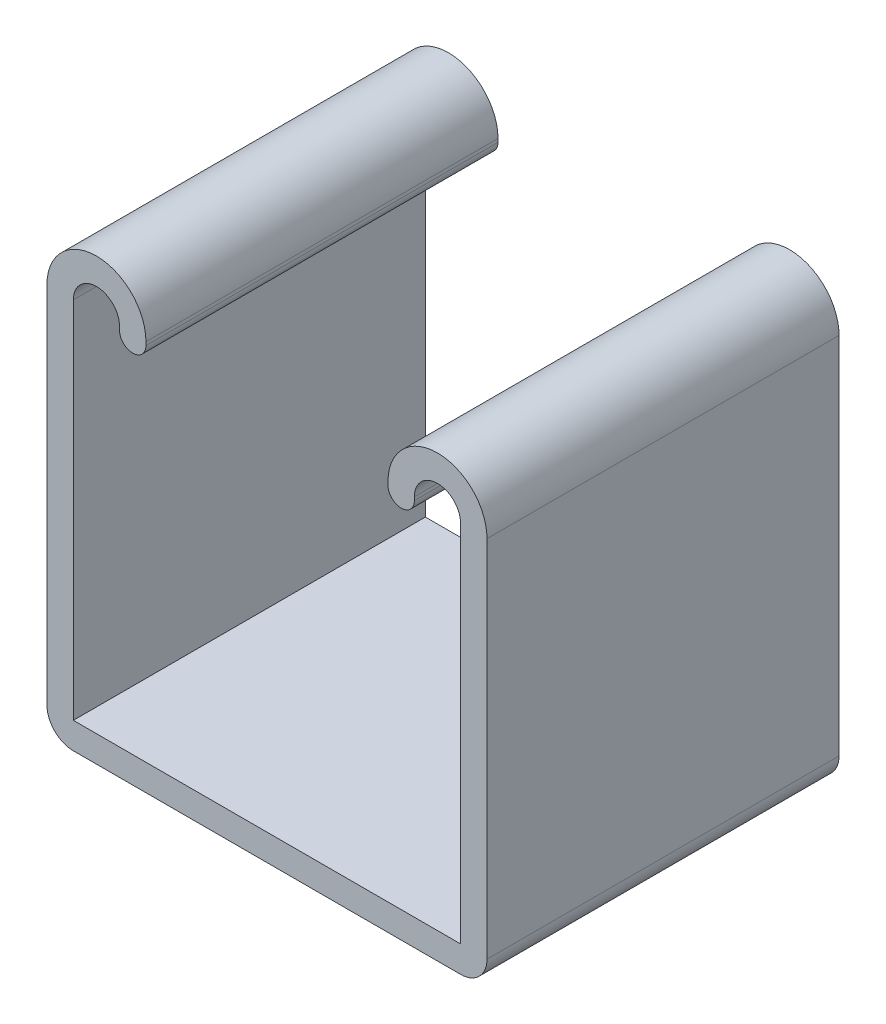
ISO-10303-21;
HEADER;
FILE_DESCRIPTION(('STEP AP214'),'2;1');
FILE_NAME('part.step','',(''),(''),'','','');
FILE_SCHEMA(('AUTOMOTIVE_DESIGN { 1 0 10303 214 1 1 1 1 }'));
ENDSEC;
DATA;
#1=APPLICATION_CONTEXT('core data for automotive mechanical design processes');
#2=APPLICATION_PROTOCOL_DEFINITION('international standard','automotive_design',2000,#1);
#3=PRODUCT_CONTEXT('',#1,'mechanical');
#4=PRODUCT('Part','Part','',(#3));
#5=PRODUCT_RELATED_PRODUCT_CATEGORY('part','',(#4));
#6=PRODUCT_DEFINITION_FORMATION('','',#4);
#7=PRODUCT_DEFINITION_CONTEXT('part definition',#1,'design');
#8=PRODUCT_DEFINITION('design','',#6,#7);
#9=PRODUCT_DEFINITION_SHAPE('','',#8);
#10=(LENGTH_UNIT() NAMED_UNIT(*) SI_UNIT(.MILLI.,.METRE.));
#11=(NAMED_UNIT(*) PLANE_ANGLE_UNIT() SI_UNIT($,.RADIAN.));
#12=(NAMED_UNIT(*) SI_UNIT($,.STERADIAN.) SOLID_ANGLE_UNIT());
#13=UNCERTAINTY_MEASURE_WITH_UNIT(LENGTH_MEASURE(1.E-05),#10,'distance_accuracy_value','');
#14=(GEOMETRIC_REPRESENTATION_CONTEXT(3) GLOBAL_UNCERTAINTY_ASSIGNED_CONTEXT((#13)) GLOBAL_UNIT_ASSIGNED_CONTEXT((#10,
#11,#12)) REPRESENTATION_CONTEXT('',''));
#15=CARTESIAN_POINT('',(0.,0.,0.));
#16=DIRECTION('',(0.,0.,1.));
#17=DIRECTION('',(1.,0.,0.));
#18=AXIS2_PLACEMENT_3D('',#15,#16,#17);
#19=CARTESIAN_POINT('',(-12.303125,14.360525,12.7));
#20=DIRECTION('',(0.,0.,-1.));
#21=DIRECTION('',(-1.,0.,0.));
#22=AXIS2_PLACEMENT_3D('',#19,#20,#21);
#23=CYLINDRICAL_SURFACE('',#22,3.571875);
#24=CARTESIAN_POINT('',(-12.303125,14.360525,-12.7));
#25=DIRECTION('',(0.,0.,1.));
#26=DIRECTION('',(-1.,0.,0.));
#27=AXIS2_PLACEMENT_3D('',#24,#25,#26);
#28=CIRCLE('',#27,3.571875);
#29=CARTESIAN_POINT('',(-8.73125,14.360525,-12.7));
#30=VERTEX_POINT('',#29);
#31=CARTESIAN_POINT('',(-15.875,14.360525,-12.7));
#32=VERTEX_POINT('',#31);
#33=EDGE_CURVE('E189',#30,#32,#28,.T.);
#34=ORIENTED_EDGE('',*,*,#33,.T.);
#35=DIRECTION('',(0.,0.,-1.));
#36=VECTOR('',#35,1.);
#37=CARTESIAN_POINT('',(-15.875,14.360525,12.7));
#38=LINE('',#37,#36);
#39=CARTESIAN_POINT('',(-15.875,14.360525,12.7));
#40=VERTEX_POINT('',#39);
#41=EDGE_CURVE('E11',#40,#32,#38,.T.);
#42=ORIENTED_EDGE('',*,*,#41,.F.);
#43=CARTESIAN_POINT('',(-12.303125,14.360525,12.7));
#44=DIRECTION('',(0.,0.,1.));
#45=DIRECTION('',(-1.,0.,0.));
#46=AXIS2_PLACEMENT_3D('',#43,#44,#45);
#47=CIRCLE('',#46,3.571875);
#48=CARTESIAN_POINT('',(-8.73125,14.360525,12.7));
#49=VERTEX_POINT('',#48);
#50=EDGE_CURVE('E223',#49,#40,#47,.T.);
#51=ORIENTED_EDGE('',*,*,#50,.F.);
#52=DIRECTION('',(0.,0.,-1.));
#53=VECTOR('',#52,1.);
#54=CARTESIAN_POINT('',(-8.73125,14.360525,12.7));
#55=LINE('',#54,#53);
#56=EDGE_CURVE('E185',#49,#30,#55,.T.);
#57=ORIENTED_EDGE('',*,*,#56,.T.);
#58=EDGE_LOOP('',(#34,#42,#51,#57));
#59=FACE_BOUND('',#58,.T.);
#60=ADVANCED_FACE('F33',(#59),#23,.T.);
#61=CARTESIAN_POINT('',(-15.875,14.360525,12.7));
#62=DIRECTION('',(1.,0.,0.));
#63=DIRECTION('',(0.,1.,0.));
#64=AXIS2_PLACEMENT_3D('',#61,#62,#63);
#65=PLANE('',#64);
#66=DIRECTION('',(0.,-1.,0.));
#67=VECTOR('',#66,1.);
#68=CARTESIAN_POINT('',(-15.875,14.360525,-12.7));
#69=LINE('',#68,#67);
#70=CARTESIAN_POINT('',(-15.875,-11.9126,-12.7));
#71=VERTEX_POINT('',#70);
#72=EDGE_CURVE('E192',#32,#71,#69,.T.);
#73=ORIENTED_EDGE('',*,*,#72,.T.);
#74=DIRECTION('',(0.,0.,-1.));
#75=VECTOR('',#74,1.);
#76=CARTESIAN_POINT('',(-15.875,-11.9126,12.7));
#77=LINE('',#76,#75);
#78=CARTESIAN_POINT('',(-15.875,-11.9126,12.7));
#79=VERTEX_POINT('',#78);
#80=EDGE_CURVE('E41',#79,#71,#77,.T.);
#81=ORIENTED_EDGE('',*,*,#80,.F.);
#82=DIRECTION('',(0.,-1.,0.));
#83=VECTOR('',#82,1.);
#84=CARTESIAN_POINT('',(-15.875,14.360525,12.7));
#85=LINE('',#84,#83);
#86=EDGE_CURVE('E122',#40,#79,#85,.T.);
#87=ORIENTED_EDGE('',*,*,#86,.F.);
#88=ORIENTED_EDGE('',*,*,#41,.T.);
#89=EDGE_LOOP('',(#73,#81,#87,#88));
#90=FACE_BOUND('',#89,.T.);
#91=ADVANCED_FACE('F331',(#90),#65,.F.);
#92=CARTESIAN_POINT('',(-13.97,-11.9126,12.7));
#93=DIRECTION('',(0.,0.,-1.));
#94=DIRECTION('',(-1.,0.,0.));
#95=AXIS2_PLACEMENT_3D('',#92,#93,#94);
#96=CYLINDRICAL_SURFACE('',#95,1.905);
#97=CARTESIAN_POINT('',(-13.97,-11.9126,-12.7));
#98=DIRECTION('',(0.,0.,1.));
#99=DIRECTION('',(-1.,0.,0.));
#100=AXIS2_PLACEMENT_3D('',#97,#98,#99);
#101=CIRCLE('',#100,1.905);
#102=CARTESIAN_POINT('',(-13.97,-13.8176,-12.7));
#103=VERTEX_POINT('',#102);
#104=EDGE_CURVE('E194',#71,#103,#101,.T.);
#105=ORIENTED_EDGE('',*,*,#104,.T.);
#106=DIRECTION('',(0.,0.,-1.));
#107=VECTOR('',#106,1.);
#108=CARTESIAN_POINT('',(-13.97,-13.8176,12.7));
#109=LINE('',#108,#107);
#110=CARTESIAN_POINT('',(-13.97,-13.8176,12.7));
#111=VERTEX_POINT('',#110);
#112=EDGE_CURVE('E260',#111,#103,#109,.T.);
#113=ORIENTED_EDGE('',*,*,#112,.F.);
#114=CARTESIAN_POINT('',(-13.97,-11.9126,12.7));
#115=DIRECTION('',(0.,0.,1.));
#116=DIRECTION('',(-1.,0.,0.));
#117=AXIS2_PLACEMENT_3D('',#114,#115,#116);
#118=CIRCLE('',#117,1.905);
#119=EDGE_CURVE('E268',#79,#111,#118,.T.);
#120=ORIENTED_EDGE('',*,*,#119,.F.);
#121=ORIENTED_EDGE('',*,*,#80,.T.);
#122=EDGE_LOOP('',(#105,#113,#120,#121));
#123=FACE_BOUND('',#122,.T.);
#124=ADVANCED_FACE('F266',(#123),#96,.T.);
#125=CARTESIAN_POINT('',(-13.97,-13.8176,12.7));
#126=DIRECTION('',(0.,1.,0.));
#127=DIRECTION('',(-1.,0.,0.));
#128=AXIS2_PLACEMENT_3D('',#125,#126,#127);
#129=PLANE('',#128);
#130=DIRECTION('',(1.,0.,0.));
#131=VECTOR('',#130,1.);
#132=CARTESIAN_POINT('',(-13.97,-13.8176,-12.7));
#133=LINE('',#132,#131);
#134=CARTESIAN_POINT('',(13.97,-13.8176,-12.7));
#135=VERTEX_POINT('',#134);
#136=EDGE_CURVE('E196',#103,#135,#133,.T.);
#137=ORIENTED_EDGE('',*,*,#136,.T.);
#138=DIRECTION('',(0.,0.,-1.));
#139=VECTOR('',#138,1.);
#140=CARTESIAN_POINT('',(13.97,-13.8176,12.7));
#141=LINE('',#140,#139);
#142=CARTESIAN_POINT('',(13.97,-13.8176,12.7));
#143=VERTEX_POINT('',#142);
#144=EDGE_CURVE('E257',#143,#135,#141,.T.);
#145=ORIENTED_EDGE('',*,*,#144,.F.);
#146=DIRECTION('',(1.,0.,0.));
#147=VECTOR('',#146,1.);
#148=CARTESIAN_POINT('',(-13.97,-13.8176,12.7));
#149=LINE('',#148,#147);
#150=EDGE_CURVE('E286',#111,#143,#149,.T.);
#151=ORIENTED_EDGE('',*,*,#150,.F.);
#152=ORIENTED_EDGE('',*,*,#112,.T.);
#153=EDGE_LOOP('',(#137,#145,#151,#152));
#154=FACE_BOUND('',#153,.T.);
#155=ADVANCED_FACE('F277',(#154),#129,.F.);
#156=CARTESIAN_POINT('',(13.97,-11.9126,12.7));
#157=DIRECTION('',(0.,0.,-1.));
#158=DIRECTION('',(-1.,0.,0.));
#159=AXIS2_PLACEMENT_3D('',#156,#157,#158);
#160=CYLINDRICAL_SURFACE('',#159,1.905);
#161=CARTESIAN_POINT('',(13.97,-11.9126,-12.7));
#162=DIRECTION('',(0.,0.,1.));
#163=DIRECTION('',(1.,0.,0.));
#164=AXIS2_PLACEMENT_3D('',#161,#162,#163);
#165=CIRCLE('',#164,1.905);
#166=CARTESIAN_POINT('',(15.875,-11.9126,-12.7));
#167=VERTEX_POINT('',#166);
#168=EDGE_CURVE('E198',#135,#167,#165,.T.);
#169=ORIENTED_EDGE('',*,*,#168,.T.);
#170=DIRECTION('',(0.,0.,-1.));
#171=VECTOR('',#170,1.);
#172=CARTESIAN_POINT('',(15.875,-11.9126,12.7));
#173=LINE('',#172,#171);
#174=CARTESIAN_POINT('',(15.875,-11.9126,12.7));
#175=VERTEX_POINT('',#174);
#176=EDGE_CURVE('E254',#175,#167,#173,.T.);
#177=ORIENTED_EDGE('',*,*,#176,.F.);
#178=CARTESIAN_POINT('',(13.97,-11.9126,12.7));
#179=DIRECTION('',(0.,0.,1.));
#180=DIRECTION('',(1.,0.,0.));
#181=AXIS2_PLACEMENT_3D('',#178,#179,#180);
#182=CIRCLE('',#181,1.905);
#183=EDGE_CURVE('E283',#143,#175,#182,.T.);
#184=ORIENTED_EDGE('',*,*,#183,.F.);
#185=ORIENTED_EDGE('',*,*,#144,.T.);
#186=EDGE_LOOP('',(#169,#177,#184,#185));
#187=FACE_BOUND('',#186,.T.);
#188=ADVANCED_FACE('F281',(#187),#160,.T.);
#189=CARTESIAN_POINT('',(15.875,-11.9126,12.7));
#190=DIRECTION('',(-1.,0.,0.));
#191=DIRECTION('',(0.,0.,1.));
#192=AXIS2_PLACEMENT_3D('',#189,#190,#191);
#193=PLANE('',#192);
#194=DIRECTION('',(0.,1.,0.));
#195=VECTOR('',#194,1.);
#196=CARTESIAN_POINT('',(15.875,-11.9126,-12.7));
#197=LINE('',#196,#195);
#198=CARTESIAN_POINT('',(15.875,14.360525,-12.7));
#199=VERTEX_POINT('',#198);
#200=EDGE_CURVE('E200',#167,#199,#197,.T.);
#201=ORIENTED_EDGE('',*,*,#200,.T.);
#202=DIRECTION('',(0.,0.,-1.));
#203=VECTOR('',#202,1.);
#204=CARTESIAN_POINT('',(15.875,14.360525,12.7));
#205=LINE('',#204,#203);
#206=CARTESIAN_POINT('',(15.875,14.360525,12.7));
#207=VERTEX_POINT('',#206);
#208=EDGE_CURVE('E251',#207,#199,#205,.T.);
#209=ORIENTED_EDGE('',*,*,#208,.F.);
#210=DIRECTION('',(0.,1.,0.));
#211=VECTOR('',#210,1.);
#212=CARTESIAN_POINT('',(15.875,-11.9126,12.7));
#213=LINE('',#212,#211);
#214=EDGE_CURVE('E285',#175,#207,#213,.T.);
#215=ORIENTED_EDGE('',*,*,#214,.F.);
#216=ORIENTED_EDGE('',*,*,#176,.T.);
#217=EDGE_LOOP('',(#201,#209,#215,#216));
#218=FACE_BOUND('',#217,.T.);
#219=ADVANCED_FACE('F344',(#218),#193,.F.);
#220=CARTESIAN_POINT('',(12.303125,14.360525,12.7));
#221=DIRECTION('',(0.,0.,-1.));
#222=DIRECTION('',(-1.,0.,0.));
#223=AXIS2_PLACEMENT_3D('',#220,#221,#222);
#224=CYLINDRICAL_SURFACE('',#223,3.571875);
#225=CARTESIAN_POINT('',(12.303125,14.360525,-12.7));
#226=DIRECTION('',(0.,0.,1.));
#227=DIRECTION('',(1.,0.,0.));
#228=AXIS2_PLACEMENT_3D('',#225,#226,#227);
#229=CIRCLE('',#228,3.571875);
#230=CARTESIAN_POINT('',(8.73125,14.360525,-12.7));
#231=VERTEX_POINT('',#230);
#232=EDGE_CURVE('E202',#199,#231,#229,.T.);
#233=ORIENTED_EDGE('',*,*,#232,.T.);
#234=DIRECTION('',(0.,0.,-1.));
#235=VECTOR('',#234,1.);
#236=CARTESIAN_POINT('',(8.73125,14.360525,12.7));
#237=LINE('',#236,#235);
#238=CARTESIAN_POINT('',(8.73125,14.360525,12.7));
#239=VERTEX_POINT('',#238);
#240=EDGE_CURVE('E248',#239,#231,#237,.T.);
#241=ORIENTED_EDGE('',*,*,#240,.F.);
#242=CARTESIAN_POINT('',(12.303125,14.360525,12.7));
#243=DIRECTION('',(0.,0.,1.));
#244=DIRECTION('',(1.,0.,0.));
#245=AXIS2_PLACEMENT_3D('',#242,#243,#244);
#246=CIRCLE('',#245,3.571875);
#247=EDGE_CURVE('E288',#207,#239,#246,.T.);
#248=ORIENTED_EDGE('',*,*,#247,.F.);
#249=ORIENTED_EDGE('',*,*,#208,.T.);
#250=EDGE_LOOP('',(#233,#241,#248,#249));
#251=FACE_BOUND('',#250,.T.);
#252=ADVANCED_FACE('F347',(#251),#224,.T.);
#253=CARTESIAN_POINT('',(8.73125,14.360525,12.7));
#254=DIRECTION('',(1.,0.,0.));
#255=DIRECTION('',(0.,0.,-1.));
#256=AXIS2_PLACEMENT_3D('',#253,#254,#255);
#257=PLANE('',#256);
#258=DIRECTION('',(0.,-1.,0.));
#259=VECTOR('',#258,1.);
#260=CARTESIAN_POINT('',(8.73125,14.360525,-12.7));
#261=LINE('',#260,#259);
#262=CARTESIAN_POINT('',(8.73125,14.1224,-12.7));
#263=VERTEX_POINT('',#262);
#264=EDGE_CURVE('E204',#231,#263,#261,.T.);
#265=ORIENTED_EDGE('',*,*,#264,.T.);
#266=DIRECTION('',(0.,0.,-1.));
#267=VECTOR('',#266,1.);
#268=CARTESIAN_POINT('',(8.73125,14.1224,12.7));
#269=LINE('',#268,#267);
#270=CARTESIAN_POINT('',(8.73125,14.1224,12.7));
#271=VERTEX_POINT('',#270);
#272=EDGE_CURVE('E245',#271,#263,#269,.T.);
#273=ORIENTED_EDGE('',*,*,#272,.F.);
#274=DIRECTION('',(0.,-1.,0.));
#275=VECTOR('',#274,1.);
#276=CARTESIAN_POINT('',(8.73125,14.360525,12.7));
#277=LINE('',#276,#275);
#278=EDGE_CURVE('E294',#239,#271,#277,.T.);
#279=ORIENTED_EDGE('',*,*,#278,.F.);
#280=ORIENTED_EDGE('',*,*,#240,.T.);
#281=EDGE_LOOP('',(#265,#273,#279,#280));
#282=FACE_BOUND('',#281,.T.);
#283=ADVANCED_FACE('F351',(#282),#257,.F.);
#284=CARTESIAN_POINT('',(9.68375,14.1224,12.7));
#285=DIRECTION('',(0.,0.,-1.));
#286=DIRECTION('',(-1.,0.,0.));
#287=AXIS2_PLACEMENT_3D('',#284,#285,#286);
#288=CYLINDRICAL_SURFACE('',#287,0.9525);
#289=CARTESIAN_POINT('',(9.68375,14.1224,-12.7));
#290=DIRECTION('',(0.,0.,1.));
#291=DIRECTION('',(1.,0.,0.));
#292=AXIS2_PLACEMENT_3D('',#289,#290,#291);
#293=CIRCLE('',#292,0.9525);
#294=CARTESIAN_POINT('',(10.63625,14.1224,-12.7));
#295=VERTEX_POINT('',#294);
#296=EDGE_CURVE('E206',#263,#295,#293,.T.);
#297=ORIENTED_EDGE('',*,*,#296,.T.);
#298=DIRECTION('',(0.,0.,-1.));
#299=VECTOR('',#298,1.);
#300=CARTESIAN_POINT('',(10.63625,14.1224,12.7));
#301=LINE('',#300,#299);
#302=CARTESIAN_POINT('',(10.63625,14.1224,12.7));
#303=VERTEX_POINT('',#302);
#304=EDGE_CURVE('E242',#303,#295,#301,.T.);
#305=ORIENTED_EDGE('',*,*,#304,.F.);
#306=CARTESIAN_POINT('',(9.68375,14.1224,12.7));
#307=DIRECTION('',(0.,0.,1.));
#308=DIRECTION('',(1.,0.,0.));
#309=AXIS2_PLACEMENT_3D('',#306,#307,#308);
#310=CIRCLE('',#309,0.9525);
#311=EDGE_CURVE('E296',#271,#303,#310,.T.);
#312=ORIENTED_EDGE('',*,*,#311,.F.);
#313=ORIENTED_EDGE('',*,*,#272,.T.);
#314=EDGE_LOOP('',(#297,#305,#312,#313));
#315=FACE_BOUND('',#314,.T.);
#316=ADVANCED_FACE('F355',(#315),#288,.T.);
#317=CARTESIAN_POINT('',(10.63625,14.360525,12.7));
#318=DIRECTION('',(-1.,0.,0.));
#319=DIRECTION('',(0.,0.,1.));
#320=AXIS2_PLACEMENT_3D('',#317,#318,#319);
#321=PLANE('',#320);
#322=DIRECTION('',(0.,1.,0.));
#323=VECTOR('',#322,1.);
#324=CARTESIAN_POINT('',(10.63625,14.360525,-12.7));
#325=LINE('',#324,#323);
#326=CARTESIAN_POINT('',(10.63625,14.360525,-12.7));
#327=VERTEX_POINT('',#326);
#328=EDGE_CURVE('E208',#295,#327,#325,.T.);
#329=ORIENTED_EDGE('',*,*,#328,.T.);
#330=DIRECTION('',(0.,0.,-1.));
#331=VECTOR('',#330,1.);
#332=CARTESIAN_POINT('',(10.63625,14.360525,12.7));
#333=LINE('',#332,#331);
#334=CARTESIAN_POINT('',(10.63625,14.360525,12.7));
#335=VERTEX_POINT('',#334);
#336=EDGE_CURVE('E239',#335,#327,#333,.T.);
#337=ORIENTED_EDGE('',*,*,#336,.F.);
#338=DIRECTION('',(0.,1.,0.));
#339=VECTOR('',#338,1.);
#340=CARTESIAN_POINT('',(10.63625,14.360525,12.7));
#341=LINE('',#340,#339);
#342=EDGE_CURVE('E298',#303,#335,#341,.T.);
#343=ORIENTED_EDGE('',*,*,#342,.F.);
#344=ORIENTED_EDGE('',*,*,#304,.T.);
#345=EDGE_LOOP('',(#329,#337,#343,#344));
#346=FACE_BOUND('',#345,.T.);
#347=ADVANCED_FACE('F359',(#346),#321,.F.);
#348=CARTESIAN_POINT('',(12.303125,14.360525,12.7));
#349=DIRECTION('',(0.,0.,-1.));
#350=DIRECTION('',(-1.,0.,0.));
#351=AXIS2_PLACEMENT_3D('',#348,#349,#350);
#352=CYLINDRICAL_SURFACE('',#351,1.666875);
#353=CARTESIAN_POINT('',(12.303125,14.360525,-12.7));
#354=DIRECTION('',(0.,0.,-1.));
#355=DIRECTION('',(1.,0.,0.));
#356=AXIS2_PLACEMENT_3D('',#353,#354,#355);
#357=CIRCLE('',#356,1.666875);
#358=CARTESIAN_POINT('',(13.97,14.360525,-12.7));
#359=VERTEX_POINT('',#358);
#360=EDGE_CURVE('E210',#327,#359,#357,.T.);
#361=ORIENTED_EDGE('',*,*,#360,.T.);
#362=DIRECTION('',(0.,0.,-1.));
#363=VECTOR('',#362,1.);
#364=CARTESIAN_POINT('',(13.97,14.360525,12.7));
#365=LINE('',#364,#363);
#366=CARTESIAN_POINT('',(13.97,14.360525,12.7));
#367=VERTEX_POINT('',#366);
#368=EDGE_CURVE('E236',#367,#359,#365,.T.);
#369=ORIENTED_EDGE('',*,*,#368,.F.);
#370=CARTESIAN_POINT('',(12.303125,14.360525,12.7));
#371=DIRECTION('',(0.,0.,-1.));
#372=DIRECTION('',(1.,0.,0.));
#373=AXIS2_PLACEMENT_3D('',#370,#371,#372);
#374=CIRCLE('',#373,1.666875);
#375=EDGE_CURVE('E300',#335,#367,#374,.T.);
#376=ORIENTED_EDGE('',*,*,#375,.F.);
#377=ORIENTED_EDGE('',*,*,#336,.T.);
#378=EDGE_LOOP('',(#361,#369,#376,#377));
#379=FACE_BOUND('',#378,.T.);
#380=ADVANCED_FACE('F363',(#379),#352,.F.);
#381=CARTESIAN_POINT('',(13.97,-11.9126,12.7));
#382=DIRECTION('',(1.,0.,0.));
#383=DIRECTION('',(0.,0.,-1.));
#384=AXIS2_PLACEMENT_3D('',#381,#382,#383);
#385=PLANE('',#384);
#386=DIRECTION('',(0.,-1.,0.));
#387=VECTOR('',#386,1.);
#388=CARTESIAN_POINT('',(13.97,-11.9126,-12.7));
#389=LINE('',#388,#387);
#390=CARTESIAN_POINT('',(13.97,-11.9126,-12.7));
#391=VERTEX_POINT('',#390);
#392=EDGE_CURVE('E212',#359,#391,#389,.T.);
#393=ORIENTED_EDGE('',*,*,#392,.T.);
#394=DIRECTION('',(0.,0.,-1.));
#395=VECTOR('',#394,1.);
#396=CARTESIAN_POINT('',(13.97,-11.9126,12.7));
#397=LINE('',#396,#395);
#398=CARTESIAN_POINT('',(13.97,-11.9126,12.7));
#399=VERTEX_POINT('',#398);
#400=EDGE_CURVE('E233',#399,#391,#397,.T.);
#401=ORIENTED_EDGE('',*,*,#400,.F.);
#402=DIRECTION('',(0.,-1.,0.));
#403=VECTOR('',#402,1.);
#404=CARTESIAN_POINT('',(13.97,-11.9126,12.7));
#405=LINE('',#404,#403);
#406=EDGE_CURVE('E302',#367,#399,#405,.T.);
#407=ORIENTED_EDGE('',*,*,#406,.F.);
#408=ORIENTED_EDGE('',*,*,#368,.T.);
#409=EDGE_LOOP('',(#393,#401,#407,#408));
#410=FACE_BOUND('',#409,.T.);
#411=ADVANCED_FACE('F367',(#410),#385,.F.);
#412=CARTESIAN_POINT('',(-13.97,-11.9126,12.7));
#413=DIRECTION('',(0.,-1.,0.));
#414=DIRECTION('',(0.,0.,-1.));
#415=AXIS2_PLACEMENT_3D('',#412,#413,#414);
#416=PLANE('',#415);
#417=DIRECTION('',(-1.,0.,0.));
#418=VECTOR('',#417,1.);
#419=CARTESIAN_POINT('',(-13.97,-11.9126,-12.7));
#420=LINE('',#419,#418);
#421=CARTESIAN_POINT('',(-13.97,-11.9126,-12.7));
#422=VERTEX_POINT('',#421);
#423=EDGE_CURVE('E214',#391,#422,#420,.T.);
#424=ORIENTED_EDGE('',*,*,#423,.T.);
#425=DIRECTION('',(0.,0.,-1.));
#426=VECTOR('',#425,1.);
#427=CARTESIAN_POINT('',(-13.97,-11.9126,12.7));
#428=LINE('',#427,#426);
#429=CARTESIAN_POINT('',(-13.97,-11.9126,12.7));
#430=VERTEX_POINT('',#429);
#431=EDGE_CURVE('E230',#430,#422,#428,.T.);
#432=ORIENTED_EDGE('',*,*,#431,.F.);
#433=DIRECTION('',(-1.,0.,0.));
#434=VECTOR('',#433,1.);
#435=CARTESIAN_POINT('',(-13.97,-11.9126,12.7));
#436=LINE('',#435,#434);
#437=EDGE_CURVE('E304',#399,#430,#436,.T.);
#438=ORIENTED_EDGE('',*,*,#437,.F.);
#439=ORIENTED_EDGE('',*,*,#400,.T.);
#440=EDGE_LOOP('',(#424,#432,#438,#439));
#441=FACE_BOUND('',#440,.T.);
#442=ADVANCED_FACE('F371',(#441),#416,.F.);
#443=CARTESIAN_POINT('',(-13.97,14.360525,12.7));
#444=DIRECTION('',(-1.,0.,0.));
#445=DIRECTION('',(0.,-1.,0.));
#446=AXIS2_PLACEMENT_3D('',#443,#444,#445);
#447=PLANE('',#446);
#448=DIRECTION('',(0.,1.,0.));
#449=VECTOR('',#448,1.);
#450=CARTESIAN_POINT('',(-13.97,14.360525,-12.7));
#451=LINE('',#450,#449);
#452=CARTESIAN_POINT('',(-13.97,14.360525,-12.7));
#453=VERTEX_POINT('',#452);
#454=EDGE_CURVE('E216',#422,#453,#451,.T.);
#455=ORIENTED_EDGE('',*,*,#454,.T.);
#456=DIRECTION('',(0.,0.,-1.));
#457=VECTOR('',#456,1.);
#458=CARTESIAN_POINT('',(-13.97,14.360525,12.7));
#459=LINE('',#458,#457);
#460=CARTESIAN_POINT('',(-13.97,14.360525,12.7));
#461=VERTEX_POINT('',#460);
#462=EDGE_CURVE('E227',#461,#453,#459,.T.);
#463=ORIENTED_EDGE('',*,*,#462,.F.);
#464=DIRECTION('',(0.,1.,0.));
#465=VECTOR('',#464,1.);
#466=CARTESIAN_POINT('',(-13.97,14.360525,12.7));
#467=LINE('',#466,#465);
#468=EDGE_CURVE('E306',#430,#461,#467,.T.);
#469=ORIENTED_EDGE('',*,*,#468,.F.);
#470=ORIENTED_EDGE('',*,*,#431,.T.);
#471=EDGE_LOOP('',(#455,#463,#469,#470));
#472=FACE_BOUND('',#471,.T.);
#473=ADVANCED_FACE('F312',(#472),#447,.F.);
#474=CARTESIAN_POINT('',(-12.303125,14.360525,12.7));
#475=DIRECTION('',(0.,0.,-1.));
#476=DIRECTION('',(-1.,0.,0.));
#477=AXIS2_PLACEMENT_3D('',#474,#475,#476);
#478=CYLINDRICAL_SURFACE('',#477,1.666875);
#479=CARTESIAN_POINT('',(-12.303125,14.360525,-12.7));
#480=DIRECTION('',(0.,0.,-1.));
#481=DIRECTION('',(-1.,0.,0.));
#482=AXIS2_PLACEMENT_3D('',#479,#480,#481);
#483=CIRCLE('',#482,1.666875);
#484=CARTESIAN_POINT('',(-10.63625,14.360525,-12.7));
#485=VERTEX_POINT('',#484);
#486=EDGE_CURVE('E218',#453,#485,#483,.T.);
#487=ORIENTED_EDGE('',*,*,#486,.T.);
#488=DIRECTION('',(0.,0.,-1.));
#489=VECTOR('',#488,1.);
#490=CARTESIAN_POINT('',(-10.63625,14.360525,12.7));
#491=LINE('',#490,#489);
#492=CARTESIAN_POINT('',(-10.63625,14.360525,12.7));
#493=VERTEX_POINT('',#492);
#494=EDGE_CURVE('E180',#493,#485,#491,.T.);
#495=ORIENTED_EDGE('',*,*,#494,.F.);
#496=CARTESIAN_POINT('',(-12.303125,14.360525,12.7));
#497=DIRECTION('',(0.,0.,-1.));
#498=DIRECTION('',(-1.,0.,0.));
#499=AXIS2_PLACEMENT_3D('',#496,#497,#498);
#500=CIRCLE('',#499,1.666875);
#501=EDGE_CURVE('E171',#461,#493,#500,.T.);
#502=ORIENTED_EDGE('',*,*,#501,.F.);
#503=ORIENTED_EDGE('',*,*,#462,.T.);
#504=EDGE_LOOP('',(#487,#495,#502,#503));
#505=FACE_BOUND('',#504,.T.);
#506=ADVANCED_FACE('F316',(#505),#478,.F.);
#507=CARTESIAN_POINT('',(-10.63625,14.360525,12.7));
#508=DIRECTION('',(1.,0.,0.));
#509=DIRECTION('',(0.,0.,-1.));
#510=AXIS2_PLACEMENT_3D('',#507,#508,#509);
#511=PLANE('',#510);
#512=DIRECTION('',(0.,-1.,0.));
#513=VECTOR('',#512,1.);
#514=CARTESIAN_POINT('',(-10.63625,14.360525,-12.7));
#515=LINE('',#514,#513);
#516=CARTESIAN_POINT('',(-10.63625,14.1224,-12.7));
#517=VERTEX_POINT('',#516);
#518=EDGE_CURVE('E179',#485,#517,#515,.T.);
#519=ORIENTED_EDGE('',*,*,#518,.T.);
#520=DIRECTION('',(0.,0.,-1.));
#521=VECTOR('',#520,1.);
#522=CARTESIAN_POINT('',(-10.63625,14.1224,12.7));
#523=LINE('',#522,#521);
#524=CARTESIAN_POINT('',(-10.63625,14.1224,12.7));
#525=VERTEX_POINT('',#524);
#526=EDGE_CURVE('E176',#525,#517,#523,.T.);
#527=ORIENTED_EDGE('',*,*,#526,.F.);
#528=DIRECTION('',(0.,-1.,0.));
#529=VECTOR('',#528,1.);
#530=CARTESIAN_POINT('',(-10.63625,14.360525,12.7));
#531=LINE('',#530,#529);
#532=EDGE_CURVE('E165',#493,#525,#531,.T.);
#533=ORIENTED_EDGE('',*,*,#532,.F.);
#534=ORIENTED_EDGE('',*,*,#494,.T.);
#535=EDGE_LOOP('',(#519,#527,#533,#534));
#536=FACE_BOUND('',#535,.T.);
#537=ADVANCED_FACE('F177',(#536),#511,.F.);
#538=CARTESIAN_POINT('',(-9.68375,14.1224,12.7));
#539=DIRECTION('',(0.,0.,-1.));
#540=DIRECTION('',(-1.,0.,0.));
#541=AXIS2_PLACEMENT_3D('',#538,#539,#540);
#542=CYLINDRICAL_SURFACE('',#541,0.9525);
#543=CARTESIAN_POINT('',(-9.68375,14.1224,-12.7));
#544=DIRECTION('',(0.,0.,1.));
#545=DIRECTION('',(-1.,0.,0.));
#546=AXIS2_PLACEMENT_3D('',#543,#544,#545);
#547=CIRCLE('',#546,0.9525);
#548=CARTESIAN_POINT('',(-8.73125,14.1224,-12.7));
#549=VERTEX_POINT('',#548);
#550=EDGE_CURVE('E108',#517,#549,#547,.T.);
#551=ORIENTED_EDGE('',*,*,#550,.T.);
#552=DIRECTION('',(0.,0.,-1.));
#553=VECTOR('',#552,1.);
#554=CARTESIAN_POINT('',(-8.73125,14.1224,12.7));
#555=LINE('',#554,#553);
#556=CARTESIAN_POINT('',(-8.73125,14.1224,12.7));
#557=VERTEX_POINT('',#556);
#558=EDGE_CURVE('E181',#557,#549,#555,.T.);
#559=ORIENTED_EDGE('',*,*,#558,.F.);
#560=CARTESIAN_POINT('',(-9.68375,14.1224,12.7));
#561=DIRECTION('',(0.,0.,1.));
#562=DIRECTION('',(-1.,0.,0.));
#563=AXIS2_PLACEMENT_3D('',#560,#561,#562);
#564=CIRCLE('',#563,0.9525);
#565=EDGE_CURVE('E169',#525,#557,#564,.T.);
#566=ORIENTED_EDGE('',*,*,#565,.F.);
#567=ORIENTED_EDGE('',*,*,#526,.T.);
#568=EDGE_LOOP('',(#551,#559,#566,#567));
#569=FACE_BOUND('',#568,.T.);
#570=ADVANCED_FACE('F183',(#569),#542,.T.);
#571=CARTESIAN_POINT('',(-8.73125,14.360525,12.7));
#572=DIRECTION('',(-1.,0.,0.));
#573=DIRECTION('',(0.,0.,1.));
#574=AXIS2_PLACEMENT_3D('',#571,#572,#573);
#575=PLANE('',#574);
#576=DIRECTION('',(0.,1.,0.));
#577=VECTOR('',#576,1.);
#578=CARTESIAN_POINT('',(-8.73125,14.360525,-12.7));
#579=LINE('',#578,#577);
#580=EDGE_CURVE('E114',#549,#30,#579,.T.);
#581=ORIENTED_EDGE('',*,*,#580,.T.);
#582=ORIENTED_EDGE('',*,*,#56,.F.);
#583=DIRECTION('',(0.,1.,0.));
#584=VECTOR('',#583,1.);
#585=CARTESIAN_POINT('',(-8.73125,14.360525,12.7));
#586=LINE('',#585,#584);
#587=EDGE_CURVE('E49',#557,#49,#586,.T.);
#588=ORIENTED_EDGE('',*,*,#587,.F.);
#589=ORIENTED_EDGE('',*,*,#558,.T.);
#590=EDGE_LOOP('',(#581,#582,#588,#589));
#591=FACE_BOUND('',#590,.T.);
#592=ADVANCED_FACE('F320',(#591),#575,.F.);
#593=CARTESIAN_POINT('',(-12.303125,14.360525,12.7));
#594=DIRECTION('',(0.,0.,-1.));
#595=DIRECTION('',(-1.,0.,0.));
#596=AXIS2_PLACEMENT_3D('',#593,#594,#595);
#597=PLANE('',#596);
#598=ORIENTED_EDGE('',*,*,#50,.T.);
#599=ORIENTED_EDGE('',*,*,#86,.T.);
#600=ORIENTED_EDGE('',*,*,#119,.T.);
#601=ORIENTED_EDGE('',*,*,#150,.T.);
#602=ORIENTED_EDGE('',*,*,#183,.T.);
#603=ORIENTED_EDGE('',*,*,#214,.T.);
#604=ORIENTED_EDGE('',*,*,#247,.T.);
#605=ORIENTED_EDGE('',*,*,#278,.T.);
#606=ORIENTED_EDGE('',*,*,#311,.T.);
#607=ORIENTED_EDGE('',*,*,#342,.T.);
#608=ORIENTED_EDGE('',*,*,#375,.T.);
#609=ORIENTED_EDGE('',*,*,#406,.T.);
#610=ORIENTED_EDGE('',*,*,#437,.T.);
#611=ORIENTED_EDGE('',*,*,#468,.T.);
#612=ORIENTED_EDGE('',*,*,#501,.T.);
#613=ORIENTED_EDGE('',*,*,#532,.T.);
#614=ORIENTED_EDGE('',*,*,#565,.T.);
#615=ORIENTED_EDGE('',*,*,#587,.T.);
#616=EDGE_LOOP('',(#598,#599,#600,#601,#602,#603,#604,#605,#606,#607,#608,#609,#610,#611,#612,
#613,#614,#615));
#617=FACE_BOUND('',#616,.T.);
#618=ADVANCED_FACE('F167',(#617),#597,.F.);
#619=CARTESIAN_POINT('',(-12.303125,14.360525,-12.7));
#620=DIRECTION('',(0.,0.,-1.));
#621=DIRECTION('',(-1.,0.,0.));
#622=AXIS2_PLACEMENT_3D('',#619,#620,#621);
#623=PLANE('',#622);
#624=ORIENTED_EDGE('',*,*,#33,.F.);
#625=ORIENTED_EDGE('',*,*,#580,.F.);
#626=ORIENTED_EDGE('',*,*,#550,.F.);
#627=ORIENTED_EDGE('',*,*,#518,.F.);
#628=ORIENTED_EDGE('',*,*,#486,.F.);
#629=ORIENTED_EDGE('',*,*,#454,.F.);
#630=ORIENTED_EDGE('',*,*,#423,.F.);
#631=ORIENTED_EDGE('',*,*,#392,.F.);
#632=ORIENTED_EDGE('',*,*,#360,.F.);
#633=ORIENTED_EDGE('',*,*,#328,.F.);
#634=ORIENTED_EDGE('',*,*,#296,.F.);
#635=ORIENTED_EDGE('',*,*,#264,.F.);
#636=ORIENTED_EDGE('',*,*,#232,.F.);
#637=ORIENTED_EDGE('',*,*,#200,.F.);
#638=ORIENTED_EDGE('',*,*,#168,.F.);
#639=ORIENTED_EDGE('',*,*,#136,.F.);
#640=ORIENTED_EDGE('',*,*,#104,.F.);
#641=ORIENTED_EDGE('',*,*,#72,.F.);
#642=EDGE_LOOP('',(#624,#625,#626,#627,#628,#629,#630,#631,#632,#633,#634,#635,#636,#637,#638,
#639,#640,#641));
#643=FACE_BOUND('',#642,.T.);
#644=ADVANCED_FACE('F272',(#643),#623,.T.);
#645=CLOSED_SHELL('',(#60,#91,#124,#155,#188,#219,#252,#283,#316,#347,#380,#411,#442,#473,#506,
#537,#570,#592,#618,#644));
#646=MANIFOLD_SOLID_BREP('B2',#645);
#647=ADVANCED_BREP_SHAPE_REPRESENTATION('',(#18,#646),#14);
#648=SHAPE_DEFINITION_REPRESENTATION(#9,#647);
ENDSEC;
END-ISO-10303-21;
